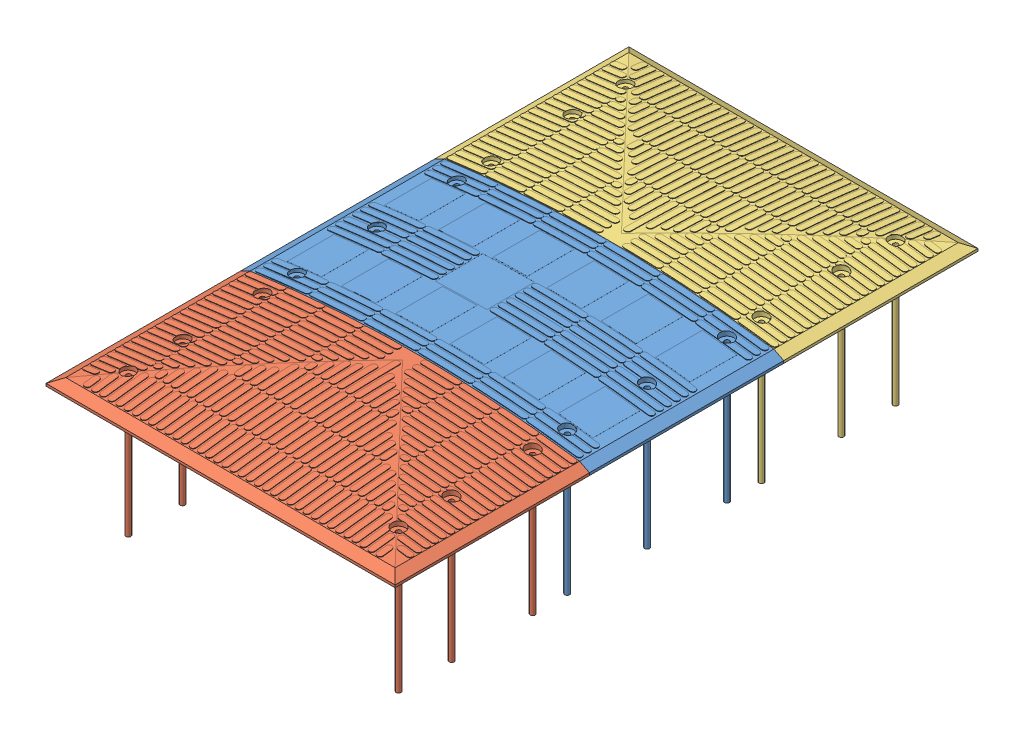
SolidWorks assembly Safety Rider Assembly.SLDASM, configuration Default (file format 6000). Lengths in mm.
Overall size (899.16 387.3 1501.14).
3 component instances, 3 part files, 6 mates.
Components (placement in the parent):
- Safety Rider Center-1: Safety Rider Center.SLDPRT [Default] at (-43.0316 153.6327 -247.7982) size (899.16 386.35 525.78)
- female end boot-1: female end boot.SLDPRT [Default] at (-43.0316 153.6327 252.5818) size (899.16 387.29 500.38)
- male end boot-1: male end boot.SLDPRT [Default] at (-43.0316 153.6327 -247.7982) x (-1 0 0) z (0 0 -1) size (899.16 387.29 525.78)
Mates (geometry in assembly coordinates):
- Coincident1: coincident aligned: plane of Safety Rider Center-1 through (-492.6116 153.6327 252.5818) normal (0 -1 0); plane of female end boot-1 through (-492.6116 153.6327 752.9618) normal (0 -1 0)
- Coincident2: coincident aligned: plane of Safety Rider Center-1 through (-492.6116 153.6327 252.5818) normal (0 -1 0); plane of male end boot-1 through (406.5484 153.6327 -748.1782) normal (0 -1 0)
- Coincident3: coincident aligned: plane of Safety Rider Center-1 through (406.5484 153.6327 252.5818) normal (1 0 0); plane of female end boot-1 through (406.5484 153.6327 752.9618) normal (1 0 0)
- Coincident5: coincident aligned: plane of Safety Rider Center-1 through (-492.6116 153.6327 252.5818) normal (-1 0 0); plane of male end boot-1 through (-492.6116 153.6327 -748.1782) normal (-1 0 0)
- Coincident6: coincident anti-aligned: plane of Safety Rider Center-1 through (-43.0316 -2792.1769 -247.7982) normal (0 0 -1); plane of male end boot-1 through (-43.0316 -2792.1769 -247.7982) normal (0 0 1)
- Coincident7: coincident anti-aligned: plane of Safety Rider Center-1 through (-43.0316 -2792.1769 252.5818) normal (0 0 1); plane of female end boot-1 through (-43.0316 -2792.1769 252.5818) normal (0 0 -1)
